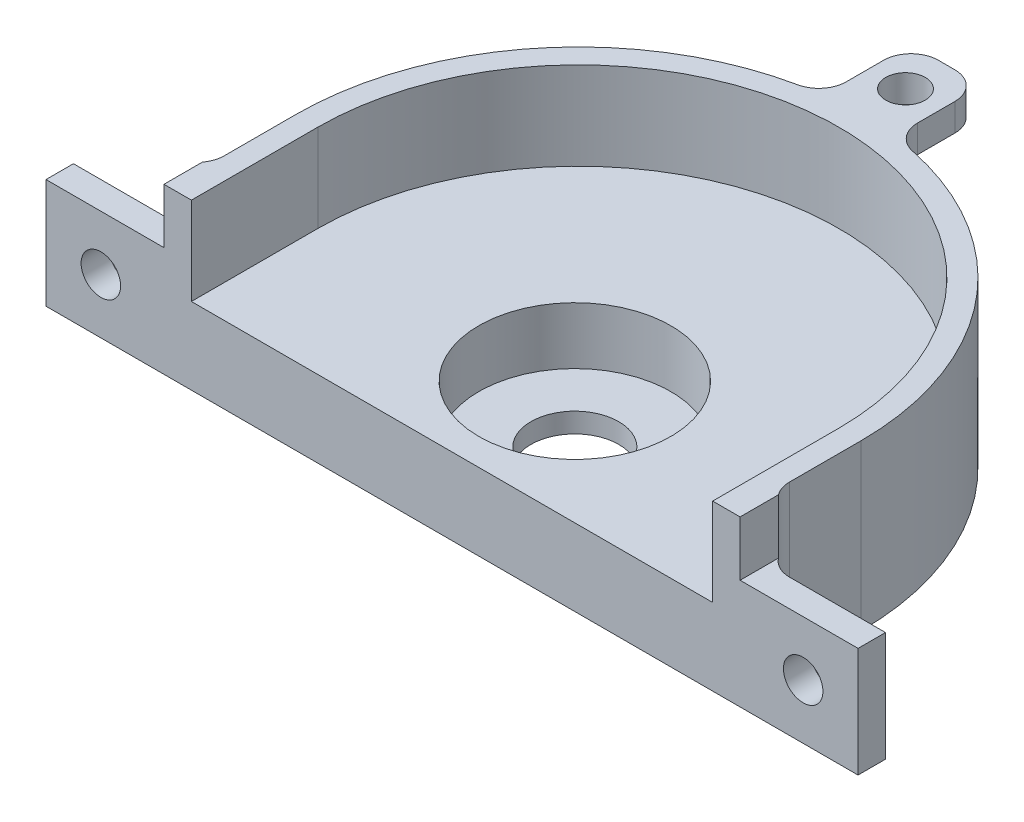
from build123d import *

# Parameters (mm, degrees)
SKETCH1_W           = 101.6
SKETCH1_H           = 76.2
EXTRUDE1_DEPTH      = 19.05
CUT_EXTRUDE1_DEPTH  = 10.16
SKETCH4_R           = 5.08
CUT_EXTRUDE2_DEPTH  = 67.295946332
SKETCH5_OUTSIDE_W   = 129.284
SKETCH5_OUTSIDE_H   = 103.884
CUT_EXTRUDE3_DEPTH  = 67.295946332
SKETCH11_R          = 11.1125
CUT_EXTRUDE10_DEPTH = 6.604
SKETCH7_R           = 2.286
CUT_EXTRUDE5_DEPTH  = 66.645733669
CUT_EXTRUDE7_START  = -3.175
CUT_EXTRUDE7_DEPTH  = 63.470733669
CUT_EXTRUDE8_DEPTH  = 79.869274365
SKETCH10_R          = 2.286
CUT_EXTRUDE9_DEPTH  = 63.743784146
FILLET2_R           = 3.175


with BuildPart() as part:
    # Sketch1 → Extrude1 (new body)
    with BuildSketch(Plane(origin=(0, 0, 0), x_dir=(1, 0, 0), z_dir=(0, 1, 0))):
        Rectangle(SKETCH1_W, SKETCH1_H)
    extrude(amount=EXTRUDE1_DEPTH)

    # Sketch2 → Cut-Extrude1 (cut)
    with BuildSketch(Plane(origin=(0, 19.05, 0), x_dir=(1, 0, 0), z_dir=(0, 1, 0))):
        with BuildLine():
            Line((-30.1625, -22.33295), (-30.1625, -46.14545))
            Line((-30.1625, -46.14545), (30.1625, -46.14545))
            Line((30.1625, -46.14545), (30.1625, -22.33295))
            ThreePointArc((30.1625, -22.33295), (0, 7.82955), (-30.1625, -22.33295))
        make_face()
    extrude(amount=-CUT_EXTRUDE1_DEPTH, mode=Mode.SUBTRACT)

    # Sketch4 → Cut-Extrude2 (cut, through all)
    with BuildSketch(Plane(origin=(0, 0, 0), x_dir=(1, 0, 0), z_dir=(0, 1, 0))):
        with Locations(Location((0, -22.7457, 0), (0, 0, 90))):
            Circle(SKETCH4_R)
    extrude(amount=CUT_EXTRUDE2_DEPTH, mode=Mode.SUBTRACT)

    # Sketch5 outside → Cut-Extrude3 (cut, through all)
    with BuildSketch(Plane(origin=(0, 19.05, 0), x_dir=(1, 0, 0), z_dir=(0, 1, 0))):
        Rectangle(SKETCH5_OUTSIDE_W, SKETCH5_OUTSIDE_H)
        with BuildLine():
            Line((-50.8, -33.782), (-35.8775, -33.782))
            ThreePointArc((-35.8775, -33.782), (-33.63243597, -32.85206403), (-32.7025, -30.607))
            Line((-32.7025, -30.607), (-32.7025, -22.33295))
            ThreePointArc((-32.7025, -22.33295), (-25.368581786, -1.695882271), (-6.656261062, 9.684977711))
            ThreePointArc((-6.656261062, 9.684977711), (-4.839530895, 10.789915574), (-4.1275, 12.793514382))
            Line((-4.1275, 12.793514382), (-4.1275, 20.286514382))
            Line((-4.1275, 20.286514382), (4.1275, 20.286514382))
            Line((4.1275, 20.286514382), (4.1275, 12.793514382))
            ThreePointArc((4.1275, 12.793514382), (4.839530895, 10.789915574), (6.656261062, 9.684977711))
            ThreePointArc((6.656261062, 9.684977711), (25.368581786, -1.695882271), (32.7025, -22.33295))
            Line((32.7025, -22.33295), (32.7025, -30.607))
            ThreePointArc((32.7025, -30.607), (33.63243597, -32.85206403), (35.8775, -33.782))
            Line((35.8775, -33.782), (50.8, -33.782))
            Line((50.8, -33.782), (50.8, -36.957))
            Line((50.8, -36.957), (30.1625, -36.957))
            Line((30.1625, -36.957), (-30.1625, -36.957))
            Line((-30.1625, -36.957), (-50.8, -36.957))
            Line((-50.8, -36.957), (-50.8, -33.782))
        make_face(mode=Mode.SUBTRACT)
    extrude(amount=-CUT_EXTRUDE3_DEPTH, mode=Mode.SUBTRACT)

    # Sketch11 → Cut-Extrude10 (cut)
    with BuildSketch(Plane(origin=(0, 8.89, 0), x_dir=(1, 0, 0), z_dir=(0, 1, 0))):
        with Locations(Location((0, -22.7457, 0), (0, 0, 270))):
            Circle(SKETCH11_R)
    extrude(amount=-CUT_EXTRUDE10_DEPTH, mode=Mode.SUBTRACT)

    # Sketch7 → Cut-Extrude5 (cut, through all)
    with BuildSketch(Plane.XY):
        with Locations(Location((-40.64, 6.35, 0), (0, 0, 180))):
            Circle(SKETCH7_R)
        with Locations(Location((40.64, 6.35, 0), (0, 0, 180))):
            Circle(SKETCH7_R)
    extrude(amount=CUT_EXTRUDE5_DEPTH, mode=Mode.SUBTRACT)

    # Sketch8 → Cut-Extrude7 (cut, through all)
    with BuildSketch(Plane(origin=(0, 19.05, 0), x_dir=(1, 0, 0), z_dir=(0, 1, 0)).offset(CUT_EXTRUDE7_START)):
        with BuildLine():
            Line((32.682519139, -21.18995), (47.625, -21.18995))
            Line((47.625, -21.18995), (47.625, 29.61005))
            Line((47.625, 29.61005), (-47.625, 29.61005))
            Line((-47.625, 29.61005), (-47.625, -21.18995))
            Line((-47.625, -21.18995), (-32.682519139, -21.18995))
            ThreePointArc((-32.682519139, -21.18995), (0, 10.36955), (32.682519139, -21.18995))
        make_face()
    extrude(amount=-CUT_EXTRUDE7_DEPTH, mode=Mode.SUBTRACT)

    # Sketch9 → Cut-Extrude8 (cut, through all)
    with BuildSketch(Plane.XY.offset(36.957)):
        Polygon((-46.99, 0), (-46.99, 12.7), (-33.3375, 12.7), (-33.3375, 19.05), (-50.8, 19.05), (-50.8, 0), align=None)
        Polygon((50.8, 0), (46.99, 0), (46.99, 12.7), (33.3375, 12.7), (33.3375, 19.05), (50.8, 19.05), align=None)
    extrude(amount=-CUT_EXTRUDE8_DEPTH, mode=Mode.SUBTRACT)

    # Sketch10 → Cut-Extrude9 (cut, through all)
    with BuildSketch(Plane(origin=(0, 0, 0), x_dir=(1, 0, 0), z_dir=(0, 1, 0))):
        with Locations(Location((0, 15.524014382, 0), (0, 0, 90))):
            Circle(SKETCH10_R)
    extrude(amount=CUT_EXTRUDE9_DEPTH, mode=Mode.SUBTRACT)

    # Fillet2
    fillet2_edges = [part.edges().sort_by_distance(p)[0] for p in [
        (4.1275, 17.4625, -20.286514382),
        (-4.1275, 17.4625, -20.286514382),
    ]]
    fillet(fillet2_edges, radius=FILLET2_R)


solid = part.part
